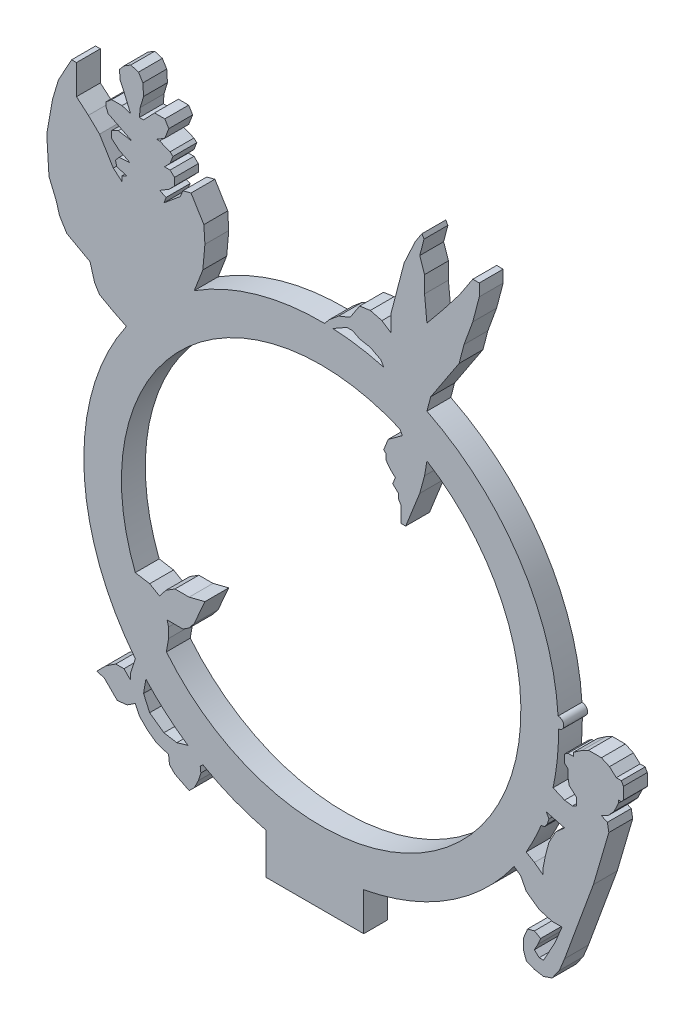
from build123d import *

# Parameters (mm, degrees)
RESSALTO_EXTRUS_O1_DEPTH = 6


with BuildPart() as part:
    # Esbo_o1 → Ressalto-extrus_o1 (new body)
    with BuildSketch(Plane.XY):
        with BuildLine():
            Line((54.648778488, 118.853702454), (53.43086633, 114.99493646))
            Line((53.43086633, 114.99493646), (53.43086633, 113.593915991))
            Line((53.43086633, 113.593915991), (51.79634245, 115.228439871))
            Line((51.79634245, 115.228439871), (49.741512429, 115.228439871))
            Line((49.741512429, 115.228439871), (47.266376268, 113.593915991))
            Line((47.266376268, 113.593915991), (44.978042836, 111.305582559))
            Line((44.978042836, 111.305582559), (46.875650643, 110.706655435))
            Line((46.875650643, 110.706655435), (48.705158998, 108.877147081))
            Line((48.705158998, 108.877147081), (50.110648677, 107.471657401))
            Line((50.110648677, 107.471657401), (52.61360439, 107.756330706))
            Line((52.61360439, 107.756330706), (54.648778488, 109.100313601))
            Line((54.648778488, 109.100313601), (55.67249908, 106.869017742))
            Line((55.67249908, 106.869017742), (57.750679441, 104.790837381))
            Line((57.750679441, 104.790837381), (60.015662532, 103.132963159))
            Line((60.015662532, 103.132963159), (63.002484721, 102.190255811))
            Line((63.002484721, 102.190255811), (63.246917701, 100.041108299))
            Line((63.246917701, 100.041108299), (64.621407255, 98.666618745))
            Line((64.621407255, 98.666618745), (66.974064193, 97.482180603))
            Line((66.974064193, 97.482180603), (68.183593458, 96.87324669))
            Line((68.183593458, 96.87324669), (69.467209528, 98.15686276))
            Line((69.467209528, 98.15686276), (70.507395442, 100.22299059))
            Line((70.507395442, 100.22299059), (71.128307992, 102.190255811))
            Line((71.128307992, 102.190255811), (70.969925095, 103.582818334))
            Line((70.969925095, 103.582818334), (71.625876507, 104.238769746))
            ThreePointArc((71.625876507, 104.238769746), (79.3604325, 100.503506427), (87.551139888, 97.917416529))
            Line((87.551139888, 97.917416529), (87.551139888, 87.657554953))
            Line((87.551139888, 87.657554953), (112.073302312, 87.657554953))
            Line((112.073302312, 87.657554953), (112.073302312, 97.260995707))
            ThreePointArc((112.073302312, 97.260995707), (133.312310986, 105.560666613), (149.887118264, 121.221311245))
            Line((149.887118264, 121.221311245), (151.534053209, 120.041840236))
            Line((151.534053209, 120.041840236), (152.953024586, 117.315040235))
            Line((152.953024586, 117.315040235), (156.192663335, 114.99493646))
            Line((156.192663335, 114.99493646), (159.427377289, 114.048700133))
            Line((159.427377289, 114.048700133), (161.935459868, 114.048700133))
            Line((161.935459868, 114.048700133), (160.127307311, 109.674137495))
            Line((160.127307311, 109.674137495), (158.276087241, 106.308609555))
            Line((158.276087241, 106.308609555), (157.283753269, 104.504541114))
            Line((157.283753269, 104.504541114), (156.192663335, 104.504541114))
            Line((156.192663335, 104.504541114), (154.987665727, 105.635713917))
            Line((154.987665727, 105.635713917), (155.900822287, 107.295837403))
            Line((155.900822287, 107.295837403), (156.554430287, 108.877147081))
            Line((156.554430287, 108.877147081), (154.987665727, 109.738951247))
            Line((154.987665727, 109.738951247), (153.272246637, 109.308049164))
            Line((153.272246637, 109.308049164), (152.243538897, 106.819240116))
            Line((152.243538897, 106.819240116), (152.243538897, 104.238769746))
            Line((152.243538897, 104.238769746), (152.953024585, 102.190255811))
            Line((152.953024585, 102.190255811), (154.987665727, 101.349270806))
            Line((154.987665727, 101.349270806), (157.283753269, 100.960223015))
            Line((157.283753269, 100.960223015), (159.427377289, 101.702649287))
            Line((159.427377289, 101.702649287), (161.243648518, 104.238769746))
            Line((161.243648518, 104.238769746), (162.579908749, 107.471657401))
            Line((162.579908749, 107.471657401), (166.184638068, 117.315040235))
            Line((166.184638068, 117.315040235), (169.815689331, 127.230300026))
            Line((169.815689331, 127.230300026), (173.702163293, 140.516232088))
            Line((173.702163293, 140.516232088), (173.327697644, 142.5581377))
            Line((173.327697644, 142.5581377), (171.839664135, 143.24298992))
            Line((171.839664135, 143.24298992), (173.514930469, 144.114620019))
            Line((173.514930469, 144.114620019), (175.039828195, 145.795620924))
            Line((175.039828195, 145.795620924), (176.100659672, 148.100574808))
            Line((176.100659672, 148.100574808), (176.100659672, 148.815196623))
            Line((176.100659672, 148.815196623), (176.845347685, 148.815196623))
            Line((176.845347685, 148.815196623), (177.361645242, 149.384347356))
            Line((177.361645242, 149.384347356), (177.361645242, 152.395105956))
            Line((177.361645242, 152.395105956), (176.845347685, 153.387425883))
            Line((176.845347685, 153.387425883), (175.570243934, 153.387425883))
            Line((175.570243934, 153.387425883), (173.863638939, 154.93555002))
            Line((173.863638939, 154.93555002), (171.839664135, 155.867063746))
            Line((171.839664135, 155.867063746), (168.587454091, 155.867063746))
            Line((168.587454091, 155.867063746), (166.984529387, 155.033072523))
            Line((166.984529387, 155.033072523), (164.808312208, 153.544859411))
            Line((164.808312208, 153.544859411), (164.808312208, 152.642502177))
            Line((164.808312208, 152.642502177), (163.435558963, 152.642502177))
            Line((163.435558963, 152.642502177), (162.579908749, 152.057363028))
            Line((162.579908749, 152.057363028), (162.579908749, 150.028107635))
            Line((162.579908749, 150.028107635), (163.435558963, 149.251915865))
            Line((163.435558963, 149.251915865), (163.435558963, 147.362450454))
            Line((163.435558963, 147.362450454), (163.722900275, 145.795620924))
            Line((163.722900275, 145.795620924), (164.995302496, 144.641378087))
            Line((164.995302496, 144.641378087), (165.575984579, 144.114620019))
            Line((165.575984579, 144.114620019), (165.575984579, 142.25746332))
            Line((165.575984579, 142.25746332), (164.55160144, 141.724483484))
            Line((164.55160144, 141.724483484), (162.579908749, 141.990973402))
            Line((162.579908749, 141.990973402), (159.672939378, 143.24298992))
            ThreePointArc((159.672939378, 143.24298992), (160.742713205, 149.96839797), (161.039218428, 156.771898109))
            ThreePointArc((161.039218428, 156.771898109), (162.365464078, 158.182037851), (160.94028993, 159.492114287))
            ThreePointArc((160.94028993, 159.492114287), (151.154538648, 188.864891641), (127.967580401, 209.380396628))
            Line((127.967580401, 209.380396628), (128.908254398, 212.986485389))
            Line((128.908254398, 212.986485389), (132.084633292, 217.805746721))
            Line((132.084633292, 217.805746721), (136.056411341, 223.831802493))
            Line((136.056411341, 223.831802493), (137.288660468, 228.555649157))
            Line((137.288660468, 228.555649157), (139.496184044, 234.608334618))
            Line((139.496184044, 234.608334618), (141.128110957, 240.864352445))
            Line((141.128110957, 240.864352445), (141.128110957, 243.891628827))
            Line((141.128110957, 243.891628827), (139.496184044, 243.891628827))
            Line((139.496184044, 243.891628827), (136.154124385, 238.820993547))
            Line((136.154124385, 238.820993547), (132.084633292, 233.580330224))
            Line((132.084633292, 233.580330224), (127.967580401, 228.555649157))
            Line((127.967580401, 228.555649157), (127.366645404, 234.608334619))
            Line((127.366645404, 234.608334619), (127.366645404, 238.820993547))
            Line((127.366645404, 238.820993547), (126.164256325, 242.377990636))
            Line((126.164256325, 242.377990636), (127.233967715, 246.478746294))
            Line((127.233967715, 246.478746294), (126.69911202, 247.391122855))
            Line((126.69911202, 247.391122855), (125.03769164, 244.861761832))
            Line((125.03769164, 244.861761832), (122.244866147, 238.820993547))
            Line((122.244866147, 238.820993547), (121.145963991, 234.608334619))
            Line((121.145963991, 234.608334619), (119.937491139, 229.975634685))
            Line((119.937491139, 229.975634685), (118.898164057, 225.991357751))
            Line((118.898164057, 225.991357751), (118.898164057, 221.964348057))
            Line((118.898164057, 221.964348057), (116.646043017, 223.443662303))
            Line((116.646043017, 223.443662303), (113.728324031, 224.204770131))
            Line((113.728324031, 224.204770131), (111.053146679, 223.824216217))
            Line((111.053146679, 223.824216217), (109.831485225, 221.964348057))
            Line((109.831485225, 221.964348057), (108.660091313, 220.181007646))
            Line((108.660091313, 220.181007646), (105.739528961, 218.982776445))
            Line((105.739528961, 218.982776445), (103.369967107, 216.98933552))
            Line((103.369967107, 216.98933552), (102.24094532, 215.627516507))
            ThreePointArc((102.24094532, 215.627516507), (85.180862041, 213.39431657), (69.467209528, 206.386125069))
            Line((69.467209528, 206.386125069), (71.625876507, 211.966858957))
            Line((71.625876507, 211.966858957), (72.146025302, 217.805746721))
            Line((72.146025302, 217.805746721), (71.885950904, 221.964348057))
            Line((71.885950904, 221.964348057), (68.658895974, 227.240185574))
            Line((68.658895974, 227.240185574), (66.589798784, 226.681567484))
            Line((66.589798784, 226.681567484), (65.994358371, 225.142194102))
            Line((65.994358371, 225.142194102), (63.002484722, 222.647103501))
            Line((63.002484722, 222.647103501), (61.836989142, 221.675131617))
            Line((61.836989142, 221.675131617), (62.419736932, 223.181691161))
            Line((62.419736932, 223.181691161), (60.73902454, 223.831802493))
            Line((60.73902454, 223.831802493), (63.246917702, 225.365797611))
            Line((63.246917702, 225.365797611), (64.498421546, 226.681567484))
            Line((64.498421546, 226.681567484), (64.498421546, 228.555649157))
            Line((64.498421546, 228.555649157), (63.396691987, 229.603567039))
            Line((63.396691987, 229.603567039), (61.992971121, 229.603567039))
            Line((61.992971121, 229.603567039), (63.396691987, 231.079370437))
            Line((63.396691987, 231.079370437), (64.103891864, 232.907672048))
            Line((64.103891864, 232.907672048), (63.396691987, 233.580330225))
            Line((63.396691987, 233.580330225), (60.73902454, 234.608334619))
            Line((60.73902454, 234.608334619), (60.015662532, 234.608334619))
            Line((60.015662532, 234.608334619), (62.067858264, 235.863594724))
            Line((62.067858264, 235.863594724), (63.067986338, 238.449194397))
            Line((63.067986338, 238.449194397), (62.067858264, 240.084280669))
            Line((62.067858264, 240.084280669), (59.486204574, 240.084280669))
            Line((59.486204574, 240.084280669), (58.257501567, 238.792482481))
            Line((58.257501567, 238.792482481), (56.726843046, 237.183223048))
            Line((56.726843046, 237.183223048), (55.67249908, 237.183223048))
            Line((55.67249908, 237.183223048), (55.873396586, 239.438381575))
            Line((55.873396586, 239.438381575), (56.726843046, 242.290323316))
            Line((56.726843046, 242.290323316), (56.547339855, 245.160587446))
            Line((56.547339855, 245.160587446), (55.449311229, 246.955729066))
            Line((55.449311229, 246.955729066), (53.52002956, 247.533068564))
            Line((53.52002956, 247.533068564), (51.79634245, 246.478746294))
            Line((51.79634245, 246.478746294), (50.676300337, 245.160587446))
            Line((50.676300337, 245.160587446), (50.818317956, 242.889719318))
            Line((50.818317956, 242.889719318), (51.79634245, 240.864352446))
            Line((51.79634245, 240.864352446), (52.862308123, 238.310802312))
            Line((52.862308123, 238.310802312), (53.43086633, 236.948805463))
            Line((53.43086633, 236.948805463), (51.307330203, 237.584275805))
            Line((51.307330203, 237.584275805), (48.705158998, 237.584275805))
            Line((48.705158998, 237.584275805), (47.266376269, 236.384394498))
            Line((47.266376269, 236.384394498), (47.338197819, 235.235964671))
            Line((47.338197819, 235.235964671), (47.814766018, 234.094332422))
            Line((47.814766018, 234.094332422), (50.818317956, 232.596643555))
            Line((50.818317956, 232.596643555), (53.146587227, 231.435677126))
            Line((53.146587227, 231.435677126), (53.861145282, 231.079370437))
            Line((53.861145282, 231.079370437), (50.344554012, 231.646529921))
            Line((50.344554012, 231.646529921), (48.705158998, 230.854886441))
            Line((48.705158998, 230.854886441), (48.705158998, 229.124622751))
            Line((48.705158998, 229.124622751), (50.606109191, 227.50938171))
            Line((50.606109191, 227.50938171), (53.311175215, 226.160529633))
            Line((53.311175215, 226.160529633), (50.606109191, 225.991357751))
            Line((50.606109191, 225.991357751), (49.655634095, 224.872759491))
            Line((49.655634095, 224.872759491), (50.006244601, 223.639364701))
            Line((50.006244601, 223.639364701), (52.538974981, 222.881442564))
            Line((52.538974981, 222.881442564), (51.272609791, 222.26993055))
            Line((51.272609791, 222.26993055), (51.272609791, 221.053770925))
            Line((51.272609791, 221.053770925), (49.121653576, 222.881442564))
            Line((49.121653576, 222.881442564), (47.814766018, 225.018042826))
            Line((47.814766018, 225.018042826), (45.650929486, 228.555649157))
            Line((45.650929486, 228.555649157), (42.852493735, 231.250708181))
            Line((42.852493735, 231.250708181), (39.854018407, 233.798518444))
            Line((39.854018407, 233.798518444), (39.854018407, 241.235115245))
            Line((39.854018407, 241.235115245), (38.641669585, 241.235115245))
            Line((38.641669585, 241.235115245), (35.334382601, 235.235964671))
            Line((35.334382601, 235.235964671), (33.841923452, 230.248649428))
            Line((33.841923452, 230.248649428), (32.382947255, 221.967606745))
            Line((32.382947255, 221.967606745), (32.9446168, 212.98648539))
            Line((32.9446168, 212.98648539), (34.823398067, 208.485813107))
            Line((34.823398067, 208.485813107), (35.584846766, 205.807151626))
            Line((35.584846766, 205.807151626), (37.418661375, 202.809090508))
            Line((37.418661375, 202.809090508), (40.751144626, 200.971917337))
            Line((40.751144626, 200.971917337), (43.281489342, 199.57695716))
            Line((43.281489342, 199.57695716), (44.393962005, 195.663446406))
            Line((44.393962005, 195.663446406), (45.650929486, 193.608459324))
            Line((45.650929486, 193.608459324), (49.121653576, 191.695075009))
            Line((49.121653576, 191.695075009), (52.40459825, 190.05806996))
            ThreePointArc((52.40459825, 190.05806996), (41.734572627, 154.084228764), (54.648778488, 118.853702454))
        make_face()
        with BuildLine():
            Line((54.648778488, 137.571124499), (58.257501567, 136.964804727))
            Line((58.257501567, 136.964804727), (60.73902454, 135.523920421))
            Line((60.73902454, 135.523920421), (62.340007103, 137.571124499))
            Line((62.340007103, 137.571124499), (64.621407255, 139.006057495))
            Line((64.621407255, 139.006057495), (68.183593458, 139.006057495))
            Line((68.183593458, 139.006057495), (72.146025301, 140.006671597))
            Line((72.146025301, 140.006671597), (70.806617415, 136.964804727))
            Line((70.806617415, 136.964804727), (69.467209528, 133.922937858))
            Line((69.467209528, 133.922937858), (68.183593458, 132.2815558))
            Line((68.183593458, 132.2815558), (66.589798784, 131.279106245))
            Line((66.589798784, 131.279106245), (62.660203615, 131.279106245))
            Line((62.660203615, 131.279106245), (63.002484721, 129.923673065))
            Line((63.002484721, 129.923673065), (63.002484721, 127.410941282))
            Line((63.002484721, 127.410941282), (62.466199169, 124.219051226))
            ThreePointArc((62.466199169, 124.219051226), (139.052042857, 122.766859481), (127.9675804, 198.560229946))
            Line((127.9675804, 198.560229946), (127.366645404, 195.013623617))
            Line((127.366645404, 195.013623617), (126.164256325, 190.592988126))
            Line((126.164256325, 190.592988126), (123.84483244, 184.756335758))
            Line((123.84483244, 184.756335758), (122.630058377, 181.699449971))
            Line((122.630058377, 181.699449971), (121.474718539, 181.699449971))
            Line((121.474718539, 181.699449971), (121.474718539, 183.228350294))
            Line((121.474718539, 183.228350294), (121.474718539, 185.579653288))
            Line((121.474718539, 185.579653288), (120.780456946, 186.795784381))
            Line((120.780456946, 186.795784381), (120.780456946, 187.955130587))
            Line((120.780456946, 187.955130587), (119.366569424, 189.290517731))
            Line((119.366569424, 189.290517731), (120.018971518, 190.93223758))
            Line((120.018971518, 190.93223758), (118.714167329, 192.164597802))
            Line((118.714167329, 192.164597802), (117.669615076, 193.608459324))
            Line((117.669615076, 193.608459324), (117.669615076, 195.013623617))
            Line((117.669615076, 195.013623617), (117.104760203, 195.54711721))
            Line((117.104760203, 195.54711721), (118.234469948, 198.389945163))
            Line((118.234469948, 198.389945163), (121.803473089, 200.971917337))
            Line((121.803473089, 200.971917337), (121.14596399, 202.123669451))
            ThreePointArc((121.14596399, 202.123669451), (66.397695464, 191.994748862), (54.648778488, 137.571124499))
        make_face(mode=Mode.SUBTRACT)
        with BuildLine():
            Line((57.304535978, 115.735805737), (56.726843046, 112.297465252))
            Line((56.726843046, 112.297465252), (58.257501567, 108.877147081))
            Line((58.257501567, 108.877147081), (61.836989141, 106.308609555))
            Line((61.836989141, 106.308609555), (65.077703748, 105.764120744))
            Line((65.077703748, 105.764120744), (67.876549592, 106.584200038))
            ThreePointArc((67.876549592, 106.584200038), (62.321547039, 110.849256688), (57.304535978, 115.735805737))
        make_face(mode=Mode.SUBTRACT)
        with BuildLine():
            Line((106.228486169, 216.650826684), (104.319612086, 215.561093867))
            ThreePointArc((104.319612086, 215.561093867), (110.767621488, 214.889892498), (117.104760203, 213.523141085))
            Line((117.104760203, 213.523141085), (116.390054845, 214.775083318))
            Line((116.390054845, 214.775083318), (113.728324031, 216.172324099))
            Line((113.728324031, 216.172324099), (112.735378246, 216.34992994))
            Line((112.735378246, 216.34992994), (111.053146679, 216.650826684))
            Line((111.053146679, 216.650826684), (109.312677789, 217.564463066))
            Line((109.312677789, 217.564463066), (107.828893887, 217.564463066))
            Line((107.828893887, 217.564463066), (106.228486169, 216.650826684))
        make_face(mode=Mode.SUBTRACT)
        with BuildLine():
            Line((158.002803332, 137.155303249), (158.640015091, 135.939563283))
            Line((158.640015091, 135.939563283), (158.227117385, 134.61710483))
            Line((158.227117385, 134.61710483), (157.511324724, 133.682182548))
            Line((157.511324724, 133.682182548), (156.684047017, 133.57236283))
            ThreePointArc((156.684047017, 133.57236283), (154.929830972, 129.651317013), (152.898071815, 125.866633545))
            Line((152.898071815, 125.866633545), (154.987665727, 124.645997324))
            Line((154.987665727, 124.645997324), (157.09768587, 123.079333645))
            Line((157.09768587, 123.079333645), (157.09768587, 124.219051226))
            Line((157.09768587, 124.219051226), (157.792212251, 127.651486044))
            Line((157.792212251, 127.651486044), (158.640015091, 130.843355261))
            Line((158.640015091, 130.843355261), (160.29135604, 133.922937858))
            Line((160.29135604, 133.922937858), (162.579908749, 135.939563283))
            Line((162.579908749, 135.939563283), (158.002803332, 137.155303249))
        make_face(mode=Mode.SUBTRACT)
    extrude(amount=RESSALTO_EXTRUS_O1_DEPTH)


solid = part.part
